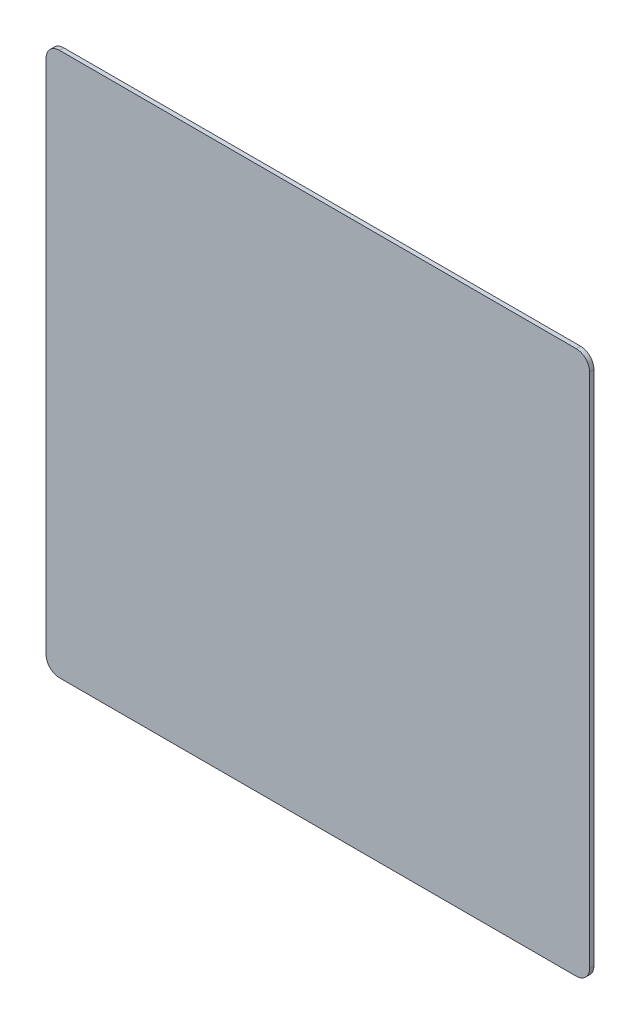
from build123d import *

# Parameters (mm, degrees)
BASE_EXTRUSION_DEPTH = 0.5


with BuildPart() as part:
    # Esquisse1 → Base-Extrusion (new body)
    with BuildSketch(Plane.XY):
        with BuildLine():
            Line((29.949747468, 30.999747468), (-29.949747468, 30.999747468))
            ThreePointArc((-29.949747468, 30.999747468), (-31.045762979, 30.545762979), (-31.499747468, 29.449747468))
            Line((-31.499747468, 29.449747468), (-31.499747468, -30.449747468))
            ThreePointArc((-31.499747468, -30.449747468), (-31.045762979, -31.545762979), (-29.949747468, -31.999747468))
            Line((-29.949747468, -31.999747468), (29.949747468, -31.999747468))
            ThreePointArc((29.949747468, -31.999747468), (31.045762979, -31.545762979), (31.499747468, -30.449747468))
            Line((31.499747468, -30.449747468), (31.499747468, 29.449747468))
            ThreePointArc((31.499747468, 29.449747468), (31.045762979, 30.545762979), (29.949747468, 30.999747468))
        make_face()
    extrude(amount=BASE_EXTRUSION_DEPTH)


solid = part.part
